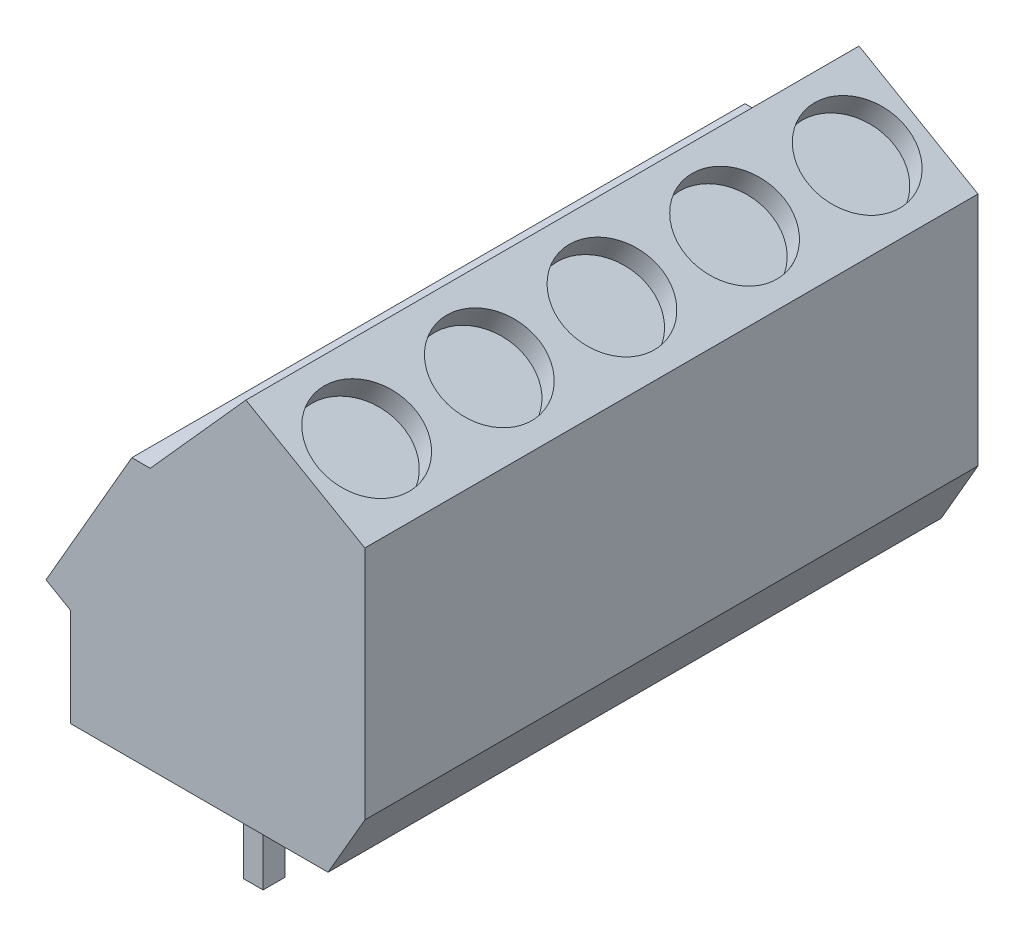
from build123d import *

# Parameters (mm, degrees)
BASE_EXTRUDE_DEPTH         = 25
SKETCH2_W                  = 2.6
SKETCH2_H                  = 3
CUT_EXTRUDE1_DEPTH         = 5
CHAMFER1_SIZE              = 1.5
CHAMFER2_SIZE              = 0.5
LPATTERN1_COUNT            = 5
LPATTERN1_PITCH            = 5
CHAMFER1_OF_LPATTERN1_SIZE = 1.5
CHAMFER2_OF_LPATTERN1_SIZE = 0.5
SKETCH3_R                  = 2
CUT_EXTRUDE3_DEPTH         = 1
SKETCH4_W                  = 0.8
SKETCH4_H                  = 0.9
BOSS_EXTRUDE1_DEPTH        = 4


with BuildPart() as part:
    # Sketch1 → Base-Extrude (new body)
    with BuildSketch(Plane.XY):
        Polygon((-12, 0), (-1.5, 0), (0, 2.598076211), (0, 12.2), (-4.849742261, 15), (-8.75, 10.639528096), (-9.5, 10.639528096), (-13, 4.577350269), (-12, 4), align=None)
    extrude(amount=BASE_EXTRUDE_DEPTH)

    # Sketch2 → Cut-Extrude1 (cut)
    with BuildSketch(Plane(origin=(-11.732050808, 6.773502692, 0), x_dir=(0, 0, 1), z_dir=(-0.8660254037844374, 0.5000000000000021, 0))):
        with Locations((2.5, 0.964101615)):
            Rectangle(SKETCH2_W, SKETCH2_H)
    cut_extrude1 = extrude(amount=-CUT_EXTRUDE1_DEPTH, mode=Mode.SUBTRACT)

    # Chamfer1
    chamfer1_edges = [part.edges().sort_by_distance(p)[0] for p in [
        (-10.5, 8.907477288, 2.5),
    ]]
    chamfer(chamfer1_edges, length=CHAMFER1_SIZE)

    # Chamfer2
    chamfer2_edges = [part.edges().sort_by_distance(p)[0] for p in [
        (-10.875, 8.257958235, 1.2),
        (-12, 6.309401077, 2.5),
        (-10.875, 8.257958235, 3.8),
    ]]
    chamfer(chamfer2_edges, length=CHAMFER2_SIZE)

    # LPattern1: Cut-Extrude1 ×5
    with Locations(*[(0, 0, i * LPATTERN1_PITCH) for i in range(1, LPATTERN1_COUNT)]):
        add(cut_extrude1, mode=Mode.SUBTRACT)

    # Chamfer1 of LPattern1
    chamfer1_of_lpattern1_edges = [part.edges().sort_by_distance(p)[0] for p in [
        (-10.5, 8.907477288, 7.5),
        (-10.5, 8.907477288, 12.5),
        (-10.5, 8.907477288, 17.5),
        (-10.5, 8.907477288, 22.5),
    ]]
    chamfer(chamfer1_of_lpattern1_edges, length=CHAMFER1_OF_LPATTERN1_SIZE)

    # Chamfer2 of LPattern1
    chamfer2_of_lpattern1_edges = [part.edges().sort_by_distance(p)[0] for p in [
        (-10.875, 8.257958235, 6.2),
        (-12, 6.309401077, 7.5),
        (-10.875, 8.257958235, 8.8),
        (-10.875, 8.257958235, 11.2),
        (-12, 6.309401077, 12.5),
        (-10.875, 8.257958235, 13.8),
        (-10.875, 8.257958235, 16.2),
        (-12, 6.309401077, 17.5),
        (-10.875, 8.257958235, 18.8),
        (-10.875, 8.257958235, 21.2),
        (-12, 6.309401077, 22.5),
        (-10.875, 8.257958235, 23.8),
    ]]
    chamfer(chamfer2_of_lpattern1_edges, length=CHAMFER2_OF_LPATTERN1_SIZE)

    # Sketch3 → Cut-Extrude3 (cut)
    with BuildSketch(Plane(origin=(5.282754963, 9.15, 0), x_dir=(-0.8660254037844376, 0.500000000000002, 0), z_dir=(0.500000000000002, 0.8660254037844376, 0))):
        with Locations((8.9, 2.5)):
            Circle(SKETCH3_R)
        with Locations((8.9, 7.5)):
            Circle(SKETCH3_R)
        with Locations((8.9, 12.5)):
            Circle(SKETCH3_R)
        with Locations((8.9, 17.5)):
            Circle(SKETCH3_R)
        with Locations((8.9, 22.5)):
            Circle(SKETCH3_R)
    extrude(amount=-CUT_EXTRUDE3_DEPTH, mode=Mode.SUBTRACT)

    # Sketch4 → Boss-Extrude1 (add)
    with BuildSketch(Plane.XZ):
        with Locations((-6.6, 2.5)):
            Rectangle(SKETCH4_W, SKETCH4_H)
        with Locations((-6.6, 7.5)):
            Rectangle(SKETCH4_W, SKETCH4_H)
        with Locations((-6.6, 12.5)):
            Rectangle(SKETCH4_W, SKETCH4_H)
        with Locations((-6.6, 17.5)):
            Rectangle(SKETCH4_W, SKETCH4_H)
        with Locations((-6.6, 22.5)):
            Rectangle(SKETCH4_W, SKETCH4_H)
    extrude(amount=BOSS_EXTRUDE1_DEPTH)


solid = part.part
